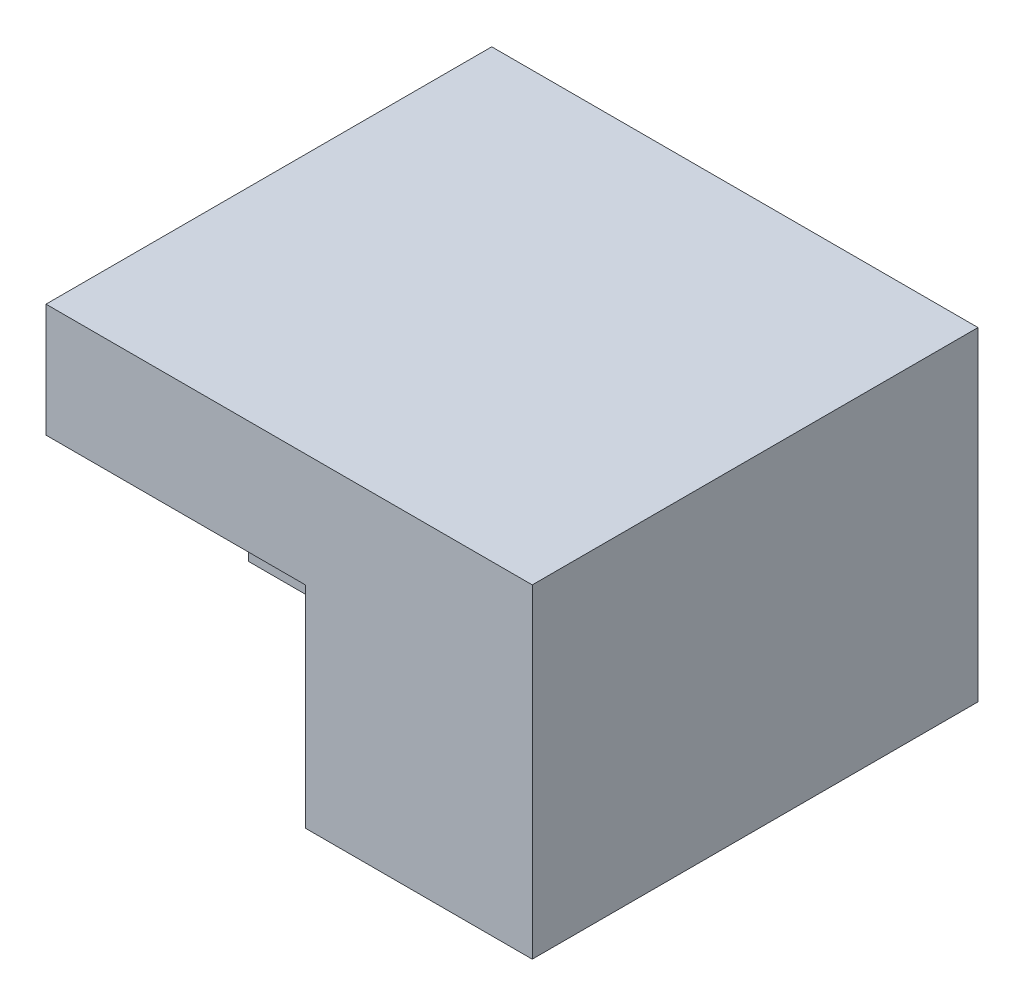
ISO-10303-21;
HEADER;
FILE_DESCRIPTION(('STEP AP214'),'2;1');
FILE_NAME('part.step','',(''),(''),'','','');
FILE_SCHEMA(('AUTOMOTIVE_DESIGN { 1 0 10303 214 1 1 1 1 }'));
ENDSEC;
DATA;
#1=APPLICATION_CONTEXT('core data for automotive mechanical design processes');
#2=APPLICATION_PROTOCOL_DEFINITION('international standard','automotive_design',2000,#1);
#3=PRODUCT_CONTEXT('',#1,'mechanical');
#4=PRODUCT('Part','Part','',(#3));
#5=PRODUCT_RELATED_PRODUCT_CATEGORY('part','',(#4));
#6=PRODUCT_DEFINITION_FORMATION('','',#4);
#7=PRODUCT_DEFINITION_CONTEXT('part definition',#1,'design');
#8=PRODUCT_DEFINITION('design','',#6,#7);
#9=PRODUCT_DEFINITION_SHAPE('','',#8);
#10=(LENGTH_UNIT() NAMED_UNIT(*) SI_UNIT(.MILLI.,.METRE.));
#11=(NAMED_UNIT(*) PLANE_ANGLE_UNIT() SI_UNIT($,.RADIAN.));
#12=(NAMED_UNIT(*) SI_UNIT($,.STERADIAN.) SOLID_ANGLE_UNIT());
#13=UNCERTAINTY_MEASURE_WITH_UNIT(LENGTH_MEASURE(1.E-05),#10,'distance_accuracy_value','');
#14=(GEOMETRIC_REPRESENTATION_CONTEXT(3) GLOBAL_UNCERTAINTY_ASSIGNED_CONTEXT((#13)) GLOBAL_UNIT_ASSIGNED_CONTEXT((#10,
#11,#12)) REPRESENTATION_CONTEXT('',''));
#15=CARTESIAN_POINT('',(0.,0.,0.));
#16=DIRECTION('',(0.,0.,1.));
#17=DIRECTION('',(1.,0.,0.));
#18=AXIS2_PLACEMENT_3D('',#15,#16,#17);
#19=CARTESIAN_POINT('',(0.,0.,55.));
#20=DIRECTION('',(-1.,0.,0.));
#21=DIRECTION('',(0.,0.,1.));
#22=AXIS2_PLACEMENT_3D('',#19,#20,#21);
#23=PLANE('',#22);
#24=DIRECTION('',(0.,1.,0.));
#25=VECTOR('',#24,1.);
#26=CARTESIAN_POINT('',(0.,0.,0.));
#27=LINE('',#26,#25);
#28=CARTESIAN_POINT('',(0.,0.,0.));
#29=VERTEX_POINT('',#28);
#30=CARTESIAN_POINT('',(0.,40.,0.));
#31=VERTEX_POINT('',#30);
#32=EDGE_CURVE('E128',#29,#31,#27,.T.);
#33=ORIENTED_EDGE('',*,*,#32,.T.);
#34=DIRECTION('',(0.,0.,-1.));
#35=VECTOR('',#34,1.);
#36=CARTESIAN_POINT('',(0.,40.,55.));
#37=LINE('',#36,#35);
#38=CARTESIAN_POINT('',(0.,40.,55.));
#39=VERTEX_POINT('',#38);
#40=EDGE_CURVE('E11',#39,#31,#37,.T.);
#41=ORIENTED_EDGE('',*,*,#40,.F.);
#42=DIRECTION('',(0.,1.,0.));
#43=VECTOR('',#42,1.);
#44=CARTESIAN_POINT('',(0.,0.,55.));
#45=LINE('',#44,#43);
#46=CARTESIAN_POINT('',(0.,0.,55.));
#47=VERTEX_POINT('',#46);
#48=EDGE_CURVE('E124',#47,#39,#45,.T.);
#49=ORIENTED_EDGE('',*,*,#48,.F.);
#50=DIRECTION('',(0.,0.,-1.));
#51=VECTOR('',#50,1.);
#52=CARTESIAN_POINT('',(0.,0.,55.));
#53=LINE('',#52,#51);
#54=EDGE_CURVE('E119',#47,#29,#53,.T.);
#55=ORIENTED_EDGE('',*,*,#54,.T.);
#56=EDGE_LOOP('',(#33,#41,#49,#55));
#57=FACE_BOUND('',#56,.T.);
#58=ADVANCED_FACE('F30',(#57),#23,.F.);
#59=CARTESIAN_POINT('',(0.,40.,55.));
#60=DIRECTION('',(0.,-1.,0.));
#61=DIRECTION('',(1.,0.,0.));
#62=AXIS2_PLACEMENT_3D('',#59,#60,#61);
#63=PLANE('',#62);
#64=DIRECTION('',(-1.,0.,0.));
#65=VECTOR('',#64,1.);
#66=CARTESIAN_POINT('',(0.,40.,0.));
#67=LINE('',#66,#65);
#68=CARTESIAN_POINT('',(-60.,40.,0.));
#69=VERTEX_POINT('',#68);
#70=EDGE_CURVE('E126',#31,#69,#67,.T.);
#71=ORIENTED_EDGE('',*,*,#70,.T.);
#72=DIRECTION('',(0.,0.,-1.));
#73=VECTOR('',#72,1.);
#74=CARTESIAN_POINT('',(-60.,40.,55.));
#75=LINE('',#74,#73);
#76=CARTESIAN_POINT('',(-60.,40.,55.));
#77=VERTEX_POINT('',#76);
#78=EDGE_CURVE('E37',#77,#69,#75,.T.);
#79=ORIENTED_EDGE('',*,*,#78,.F.);
#80=DIRECTION('',(-1.,0.,0.));
#81=VECTOR('',#80,1.);
#82=CARTESIAN_POINT('',(0.,40.,55.));
#83=LINE('',#82,#81);
#84=EDGE_CURVE('E77',#39,#77,#83,.T.);
#85=ORIENTED_EDGE('',*,*,#84,.F.);
#86=ORIENTED_EDGE('',*,*,#40,.T.);
#87=EDGE_LOOP('',(#71,#79,#85,#86));
#88=FACE_BOUND('',#87,.T.);
#89=ADVANCED_FACE('F153',(#88),#63,.F.);
#90=CARTESIAN_POINT('',(-60.,0.,55.));
#91=DIRECTION('',(1.,0.,0.));
#92=DIRECTION('',(0.,0.,-1.));
#93=AXIS2_PLACEMENT_3D('',#90,#91,#92);
#94=PLANE('',#93);
#95=DIRECTION('',(0.,-1.,0.));
#96=VECTOR('',#95,1.);
#97=CARTESIAN_POINT('',(-60.,0.,30.));
#98=LINE('',#97,#96);
#99=CARTESIAN_POINT('',(-60.,26.,30.));
#100=VERTEX_POINT('',#99);
#101=CARTESIAN_POINT('',(-60.,0.,30.));
#102=VERTEX_POINT('',#101);
#103=EDGE_CURVE('E98',#100,#102,#98,.T.);
#104=ORIENTED_EDGE('',*,*,#103,.F.);
#105=DIRECTION('',(0.,0.,1.));
#106=VECTOR('',#105,1.);
#107=CARTESIAN_POINT('',(-60.,26.,30.));
#108=LINE('',#107,#106);
#109=CARTESIAN_POINT('',(-60.,26.,55.));
#110=VERTEX_POINT('',#109);
#111=EDGE_CURVE('E131',#100,#110,#108,.T.);
#112=ORIENTED_EDGE('',*,*,#111,.T.);
#113=DIRECTION('',(0.,-1.,0.));
#114=VECTOR('',#113,1.);
#115=CARTESIAN_POINT('',(-60.,0.,55.));
#116=LINE('',#115,#114);
#117=EDGE_CURVE('E133',#77,#110,#116,.T.);
#118=ORIENTED_EDGE('',*,*,#117,.F.);
#119=ORIENTED_EDGE('',*,*,#78,.T.);
#120=DIRECTION('',(0.,-1.,0.));
#121=VECTOR('',#120,1.);
#122=CARTESIAN_POINT('',(-60.,0.,0.));
#123=LINE('',#122,#121);
#124=CARTESIAN_POINT('',(-60.,0.,0.));
#125=VERTEX_POINT('',#124);
#126=EDGE_CURVE('E118',#69,#125,#123,.T.);
#127=ORIENTED_EDGE('',*,*,#126,.T.);
#128=DIRECTION('',(0.,0.,-1.));
#129=VECTOR('',#128,1.);
#130=CARTESIAN_POINT('',(-60.,0.,55.));
#131=LINE('',#130,#129);
#132=EDGE_CURVE('E111',#102,#125,#131,.T.);
#133=ORIENTED_EDGE('',*,*,#132,.F.);
#134=EDGE_LOOP('',(#104,#112,#118,#119,#127,#133));
#135=FACE_BOUND('',#134,.T.);
#136=ADVANCED_FACE('F115',(#135),#94,.F.);
#137=CARTESIAN_POINT('',(0.,0.,55.));
#138=DIRECTION('',(0.,1.,0.));
#139=DIRECTION('',(-1.,0.,0.));
#140=AXIS2_PLACEMENT_3D('',#137,#138,#139);
#141=PLANE('',#140);
#142=DIRECTION('',(1.,0.,0.));
#143=VECTOR('',#142,1.);
#144=CARTESIAN_POINT('',(0.,0.,55.));
#145=LINE('',#144,#143);
#146=CARTESIAN_POINT('',(-28.,0.,55.));
#147=VERTEX_POINT('',#146);
#148=EDGE_CURVE('E52',#147,#47,#145,.T.);
#149=ORIENTED_EDGE('',*,*,#148,.F.);
#150=DIRECTION('',(0.,0.,1.));
#151=VECTOR('',#150,1.);
#152=CARTESIAN_POINT('',(-28.,0.,30.));
#153=LINE('',#152,#151);
#154=CARTESIAN_POINT('',(-28.,0.,30.));
#155=VERTEX_POINT('',#154);
#156=EDGE_CURVE('E44',#155,#147,#153,.T.);
#157=ORIENTED_EDGE('',*,*,#156,.F.);
#158=DIRECTION('',(1.,0.,0.));
#159=VECTOR('',#158,1.);
#160=CARTESIAN_POINT('',(-60.,0.,30.));
#161=LINE('',#160,#159);
#162=EDGE_CURVE('E102',#102,#155,#161,.T.);
#163=ORIENTED_EDGE('',*,*,#162,.F.);
#164=ORIENTED_EDGE('',*,*,#132,.T.);
#165=DIRECTION('',(1.,0.,0.));
#166=VECTOR('',#165,1.);
#167=CARTESIAN_POINT('',(0.,0.,0.));
#168=LINE('',#167,#166);
#169=EDGE_CURVE('E72',#125,#29,#168,.T.);
#170=ORIENTED_EDGE('',*,*,#169,.T.);
#171=ORIENTED_EDGE('',*,*,#54,.F.);
#172=EDGE_LOOP('',(#149,#157,#163,#164,#170,#171));
#173=FACE_BOUND('',#172,.T.);
#174=ADVANCED_FACE('F110',(#173),#141,.F.);
#175=CARTESIAN_POINT('',(0.,40.,55.));
#176=DIRECTION('',(0.,0.,1.));
#177=DIRECTION('',(1.,0.,0.));
#178=AXIS2_PLACEMENT_3D('',#175,#176,#177);
#179=PLANE('',#178);
#180=DIRECTION('',(-1.,0.,0.));
#181=VECTOR('',#180,1.);
#182=CARTESIAN_POINT('',(-60.,26.,55.));
#183=LINE('',#182,#181);
#184=CARTESIAN_POINT('',(-28.,26.,55.));
#185=VERTEX_POINT('',#184);
#186=EDGE_CURVE('E108',#185,#110,#183,.T.);
#187=ORIENTED_EDGE('',*,*,#186,.F.);
#188=DIRECTION('',(0.,1.,0.));
#189=VECTOR('',#188,1.);
#190=CARTESIAN_POINT('',(-28.,0.,55.));
#191=LINE('',#190,#189);
#192=EDGE_CURVE('E143',#147,#185,#191,.T.);
#193=ORIENTED_EDGE('',*,*,#192,.F.);
#194=ORIENTED_EDGE('',*,*,#148,.T.);
#195=ORIENTED_EDGE('',*,*,#48,.T.);
#196=ORIENTED_EDGE('',*,*,#84,.T.);
#197=ORIENTED_EDGE('',*,*,#117,.T.);
#198=EDGE_LOOP('',(#187,#193,#194,#195,#196,#197));
#199=FACE_BOUND('',#198,.T.);
#200=ADVANCED_FACE('F150',(#199),#179,.T.);
#201=CARTESIAN_POINT('',(0.,40.,0.));
#202=DIRECTION('',(0.,0.,1.));
#203=DIRECTION('',(1.,0.,0.));
#204=AXIS2_PLACEMENT_3D('',#201,#202,#203);
#205=PLANE('',#204);
#206=ORIENTED_EDGE('',*,*,#32,.F.);
#207=ORIENTED_EDGE('',*,*,#169,.F.);
#208=ORIENTED_EDGE('',*,*,#126,.F.);
#209=ORIENTED_EDGE('',*,*,#70,.F.);
#210=EDGE_LOOP('',(#206,#207,#208,#209));
#211=FACE_BOUND('',#210,.T.);
#212=ADVANCED_FACE('F156',(#211),#205,.F.);
#213=CARTESIAN_POINT('',(-60.,26.,30.));
#214=DIRECTION('',(0.,1.,0.));
#215=DIRECTION('',(0.,0.,1.));
#216=AXIS2_PLACEMENT_3D('',#213,#214,#215);
#217=PLANE('',#216);
#218=ORIENTED_EDGE('',*,*,#186,.T.);
#219=ORIENTED_EDGE('',*,*,#111,.F.);
#220=DIRECTION('',(-1.,0.,0.));
#221=VECTOR('',#220,1.);
#222=CARTESIAN_POINT('',(-60.,26.,30.));
#223=LINE('',#222,#221);
#224=CARTESIAN_POINT('',(-28.,26.,30.));
#225=VERTEX_POINT('',#224);
#226=EDGE_CURVE('E104',#225,#100,#223,.T.);
#227=ORIENTED_EDGE('',*,*,#226,.F.);
#228=DIRECTION('',(0.,0.,1.));
#229=VECTOR('',#228,1.);
#230=CARTESIAN_POINT('',(-28.,26.,30.));
#231=LINE('',#230,#229);
#232=EDGE_CURVE('E139',#225,#185,#231,.T.);
#233=ORIENTED_EDGE('',*,*,#232,.T.);
#234=EDGE_LOOP('',(#218,#219,#227,#233));
#235=FACE_BOUND('',#234,.T.);
#236=ADVANCED_FACE('F147',(#235),#217,.F.);
#237=CARTESIAN_POINT('',(-28.,0.,30.));
#238=DIRECTION('',(1.,0.,0.));
#239=DIRECTION('',(0.,0.,-1.));
#240=AXIS2_PLACEMENT_3D('',#237,#238,#239);
#241=PLANE('',#240);
#242=ORIENTED_EDGE('',*,*,#192,.T.);
#243=ORIENTED_EDGE('',*,*,#232,.F.);
#244=DIRECTION('',(0.,1.,0.));
#245=VECTOR('',#244,1.);
#246=CARTESIAN_POINT('',(-28.,0.,30.));
#247=LINE('',#246,#245);
#248=EDGE_CURVE('E113',#155,#225,#247,.T.);
#249=ORIENTED_EDGE('',*,*,#248,.F.);
#250=ORIENTED_EDGE('',*,*,#156,.T.);
#251=EDGE_LOOP('',(#242,#243,#249,#250));
#252=FACE_BOUND('',#251,.T.);
#253=ADVANCED_FACE('F173',(#252),#241,.F.);
#254=CARTESIAN_POINT('',(-60.,26.,30.));
#255=DIRECTION('',(0.,0.,-1.));
#256=DIRECTION('',(-1.,0.,0.));
#257=AXIS2_PLACEMENT_3D('',#254,#255,#256);
#258=PLANE('',#257);
#259=ORIENTED_EDGE('',*,*,#103,.T.);
#260=ORIENTED_EDGE('',*,*,#162,.T.);
#261=ORIENTED_EDGE('',*,*,#248,.T.);
#262=ORIENTED_EDGE('',*,*,#226,.T.);
#263=EDGE_LOOP('',(#259,#260,#261,#262));
#264=FACE_BOUND('',#263,.T.);
#265=ADVANCED_FACE('F100',(#264),#258,.F.);
#266=CLOSED_SHELL('',(#58,#89,#136,#174,#200,#212,#236,#253,#265));
#267=MANIFOLD_SOLID_BREP('B2',#266);
#268=ADVANCED_BREP_SHAPE_REPRESENTATION('',(#18,#267),#14);
#269=SHAPE_DEFINITION_REPRESENTATION(#9,#268);
ENDSEC;
END-ISO-10303-21;
